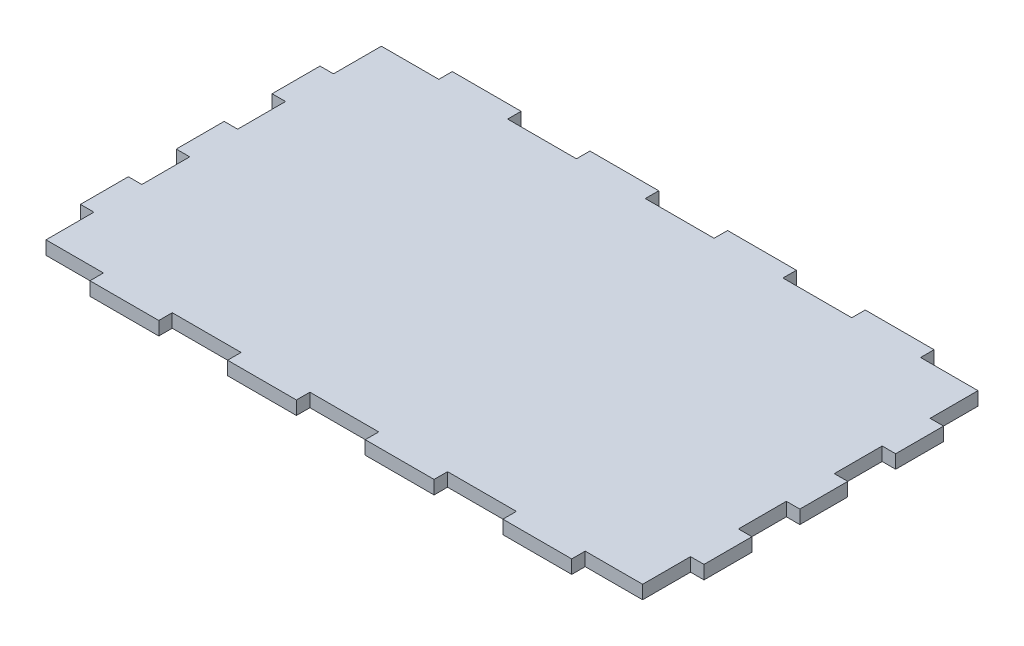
from build123d import *

# Parameters (mm, degrees)
BOSS_EXTRUDE2_DEPTH = 9


with BuildPart() as part:
    # Sketch2 → Boss-Extrude2 (new body)
    with BuildSketch(Plane(origin=(0, 0, 0), x_dir=(1, 0, 0), z_dir=(0, 1, 0))):
        Polygon((6.24, -32.004), (6.24, 0), (44.594, 0), (44.594, 9), (90.568, 9), (90.568, 0), (136.542, 0), (136.542, 9), (182.516, 9), (182.516, 0), (228.49, 0), (228.49, 9), (274.464, 9), (274.464, 0), (320.438, 0), (320.438, 9), (366.412, 9), (366.412, 0), (404.766, 0), (404.766, -32.004), (413.766, -32.004), (413.766, -64.008), (404.766, -64.008), (404.766, -96.012), (413.766, -96.012), (413.766, -128.016), (404.766, -128.016), (404.766, -160.02), (413.766, -160.02), (413.766, -192.024), (404.766, -192.024), (404.766, -224.028), (366.412, -224.028), (366.412, -233.028), (320.438, -233.028), (320.438, -224.028), (274.464, -224.028), (274.464, -233.028), (228.49, -233.028), (228.49, -224.028), (182.516, -224.028), (182.516, -233.028), (136.542, -233.028), (136.542, -224.028), (90.568, -224.028), (90.568, -233.028), (44.594, -233.028), (44.594, -224.028), (6.24, -224.028), (6.24, -192.024), (-2.76, -192.024), (-2.76, -160.02), (6.24, -160.02), (6.24, -128.016), (-2.76, -128.016), (-2.76, -96.012), (6.24, -96.012), (6.24, -64.008), (-2.76, -64.008), (-2.76, -32.004), align=None)
    extrude(amount=BOSS_EXTRUDE2_DEPTH)


solid = part.part
